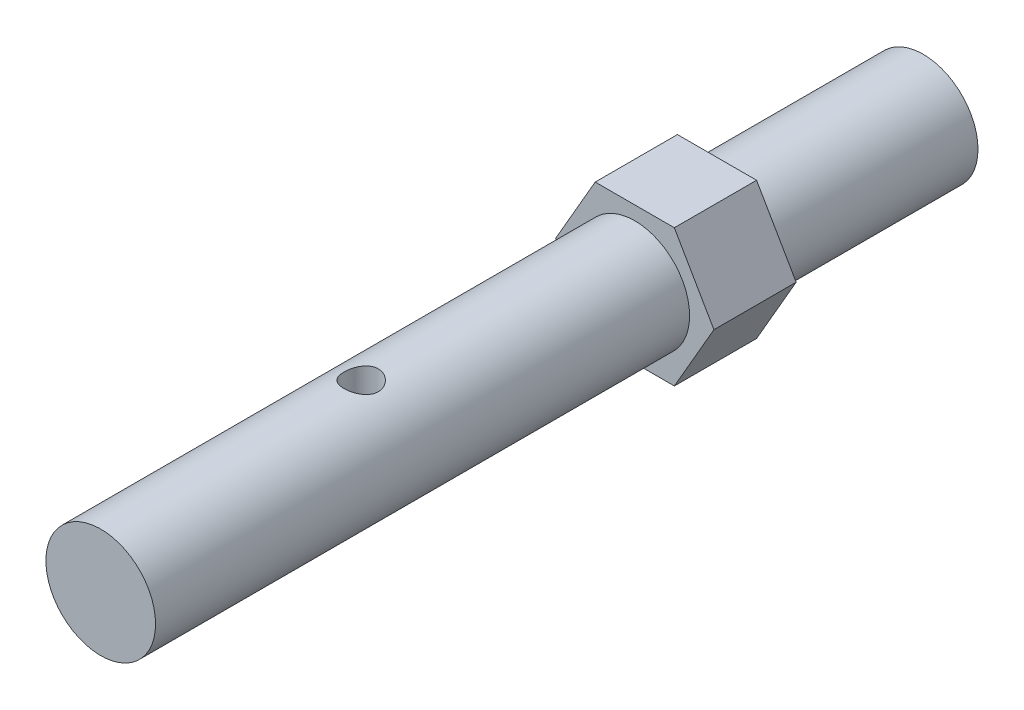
ISO-10303-21;
HEADER;
FILE_DESCRIPTION(('STEP AP214'),'2;1');
FILE_NAME('part.step','',(''),(''),'','','');
FILE_SCHEMA(('AUTOMOTIVE_DESIGN { 1 0 10303 214 1 1 1 1 }'));
ENDSEC;
DATA;
#1=APPLICATION_CONTEXT('core data for automotive mechanical design processes');
#2=APPLICATION_PROTOCOL_DEFINITION('international standard','automotive_design',2000,#1);
#3=PRODUCT_CONTEXT('',#1,'mechanical');
#4=PRODUCT('Part','Part','',(#3));
#5=PRODUCT_RELATED_PRODUCT_CATEGORY('part','',(#4));
#6=PRODUCT_DEFINITION_FORMATION('','',#4);
#7=PRODUCT_DEFINITION_CONTEXT('part definition',#1,'design');
#8=PRODUCT_DEFINITION('design','',#6,#7);
#9=PRODUCT_DEFINITION_SHAPE('','',#8);
#10=(LENGTH_UNIT() NAMED_UNIT(*) SI_UNIT(.MILLI.,.METRE.));
#11=(NAMED_UNIT(*) PLANE_ANGLE_UNIT() SI_UNIT($,.RADIAN.));
#12=(NAMED_UNIT(*) SI_UNIT($,.STERADIAN.) SOLID_ANGLE_UNIT());
#13=UNCERTAINTY_MEASURE_WITH_UNIT(LENGTH_MEASURE(1.E-05),#10,'distance_accuracy_value','');
#14=(GEOMETRIC_REPRESENTATION_CONTEXT(3) GLOBAL_UNCERTAINTY_ASSIGNED_CONTEXT((#13)) GLOBAL_UNIT_ASSIGNED_CONTEXT((#10,
#11,#12)) REPRESENTATION_CONTEXT('',''));
#15=CARTESIAN_POINT('',(0.,0.,0.));
#16=DIRECTION('',(0.,0.,1.));
#17=DIRECTION('',(1.,0.,0.));
#18=AXIS2_PLACEMENT_3D('',#15,#16,#17);
#19=CARTESIAN_POINT('',(0.,0.,23.8125));
#20=DIRECTION('',(0.,0.,-1.));
#21=DIRECTION('',(-1.,0.,0.));
#22=AXIS2_PLACEMENT_3D('',#19,#20,#21);
#23=CYLINDRICAL_SURFACE('',#22,3.175);
#24=CARTESIAN_POINT('',(0.,0.,-23.8125));
#25=DIRECTION('',(0.,0.,1.));
#26=DIRECTION('',(1.,0.,0.));
#27=AXIS2_PLACEMENT_3D('',#24,#25,#26);
#28=CIRCLE('',#27,3.175);
#29=CARTESIAN_POINT('',(3.175,0.,-23.8125));
#30=VERTEX_POINT('',#29);
#31=EDGE_CURVE('E149',#30,#30,#28,.T.);
#32=ORIENTED_EDGE('',*,*,#31,.T.);
#33=EDGE_LOOP('',(#32));
#34=FACE_BOUND('',#33,.T.);
#35=CARTESIAN_POINT('',(0.,0.,-11.8745));
#36=DIRECTION('',(0.,0.,1.));
#37=DIRECTION('',(1.,0.,0.));
#38=AXIS2_PLACEMENT_3D('',#35,#36,#37);
#39=CIRCLE('',#38,3.175);
#40=CARTESIAN_POINT('',(3.175,0.,-11.8745));
#41=VERTEX_POINT('',#40);
#42=EDGE_CURVE('E11',#41,#41,#39,.T.);
#43=ORIENTED_EDGE('',*,*,#42,.F.);
#44=EDGE_LOOP('',(#43));
#45=FACE_BOUND('',#44,.T.);
#46=ADVANCED_FACE('F33',(#34,#45),#23,.T.);
#47=CARTESIAN_POINT('',(0.,0.,-23.8125));
#48=DIRECTION('',(0.,0.,1.));
#49=DIRECTION('',(1.,0.,0.));
#50=AXIS2_PLACEMENT_3D('',#47,#48,#49);
#51=PLANE('',#50);
#52=ORIENTED_EDGE('',*,*,#31,.F.);
#53=EDGE_LOOP('',(#52));
#54=FACE_BOUND('',#53,.T.);
#55=ADVANCED_FACE('F174',(#54),#51,.F.);
#56=CARTESIAN_POINT('',(2.29135888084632,-3.96875,-11.8745));
#57=DIRECTION('',(0.866025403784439,-0.5,0.));
#58=DIRECTION('',(0.5,0.866025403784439,0.));
#59=AXIS2_PLACEMENT_3D('',#56,#57,#58);
#60=PLANE('',#59);
#61=DIRECTION('',(0.5,0.866025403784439,0.));
#62=VECTOR('',#61,1.);
#63=CARTESIAN_POINT('',(2.29135888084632,-3.96875,-7.11199999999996));
#64=LINE('',#63,#62);
#65=CARTESIAN_POINT('',(2.29135888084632,-3.96875,-7.11199999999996));
#66=VERTEX_POINT('',#65);
#67=CARTESIAN_POINT('',(4.58271776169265,0.,-7.11199999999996));
#68=VERTEX_POINT('',#67);
#69=EDGE_CURVE('E122',#66,#68,#64,.T.);
#70=ORIENTED_EDGE('',*,*,#69,.F.);
#71=DIRECTION('',(0.,0.,1.));
#72=VECTOR('',#71,1.);
#73=CARTESIAN_POINT('',(2.29135888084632,-3.96875,-11.8745));
#74=LINE('',#73,#72);
#75=CARTESIAN_POINT('',(2.29135888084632,-3.96875,-11.8745));
#76=VERTEX_POINT('',#75);
#77=EDGE_CURVE('E51',#76,#66,#74,.T.);
#78=ORIENTED_EDGE('',*,*,#77,.F.);
#79=DIRECTION('',(0.5,0.866025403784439,0.));
#80=VECTOR('',#79,1.);
#81=CARTESIAN_POINT('',(2.29135888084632,-3.96875,-11.8745));
#82=LINE('',#81,#80);
#83=CARTESIAN_POINT('',(4.58271776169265,0.,-11.8745));
#84=VERTEX_POINT('',#83);
#85=EDGE_CURVE('E137',#76,#84,#82,.T.);
#86=ORIENTED_EDGE('',*,*,#85,.T.);
#87=DIRECTION('',(0.,0.,1.));
#88=VECTOR('',#87,1.);
#89=CARTESIAN_POINT('',(4.58271776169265,0.,-11.8745));
#90=LINE('',#89,#88);
#91=EDGE_CURVE('E86',#84,#68,#90,.T.);
#92=ORIENTED_EDGE('',*,*,#91,.T.);
#93=EDGE_LOOP('',(#70,#78,#86,#92));
#94=FACE_BOUND('',#93,.T.);
#95=ADVANCED_FACE('F168',(#94),#60,.T.);
#96=CARTESIAN_POINT('',(-2.29135888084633,-3.96875,-11.8745));
#97=DIRECTION('',(0.,-1.,0.));
#98=DIRECTION('',(1.,0.,0.));
#99=AXIS2_PLACEMENT_3D('',#96,#97,#98);
#100=PLANE('',#99);
#101=DIRECTION('',(1.,0.,0.));
#102=VECTOR('',#101,1.);
#103=CARTESIAN_POINT('',(-2.29135888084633,-3.96875,-7.11199999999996));
#104=LINE('',#103,#102);
#105=CARTESIAN_POINT('',(-2.29135888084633,-3.96875,-7.11199999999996));
#106=VERTEX_POINT('',#105);
#107=EDGE_CURVE('E134',#106,#66,#104,.T.);
#108=ORIENTED_EDGE('',*,*,#107,.F.);
#109=DIRECTION('',(0.,0.,1.));
#110=VECTOR('',#109,1.);
#111=CARTESIAN_POINT('',(-2.29135888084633,-3.96875,-11.8745));
#112=LINE('',#111,#110);
#113=CARTESIAN_POINT('',(-2.29135888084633,-3.96875,-11.8745));
#114=VERTEX_POINT('',#113);
#115=EDGE_CURVE('E74',#114,#106,#112,.T.);
#116=ORIENTED_EDGE('',*,*,#115,.F.);
#117=DIRECTION('',(1.,0.,0.));
#118=VECTOR('',#117,1.);
#119=CARTESIAN_POINT('',(-2.29135888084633,-3.96875,-11.8745));
#120=LINE('',#119,#118);
#121=EDGE_CURVE('E112',#114,#76,#120,.T.);
#122=ORIENTED_EDGE('',*,*,#121,.T.);
#123=ORIENTED_EDGE('',*,*,#77,.T.);
#124=EDGE_LOOP('',(#108,#116,#122,#123));
#125=FACE_BOUND('',#124,.T.);
#126=ADVANCED_FACE('F181',(#125),#100,.T.);
#127=CARTESIAN_POINT('',(-4.58271776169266,0.,-11.8745));
#128=DIRECTION('',(-0.866025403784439,-0.5,0.));
#129=DIRECTION('',(0.5,-0.866025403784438,0.));
#130=AXIS2_PLACEMENT_3D('',#127,#128,#129);
#131=PLANE('',#130);
#132=DIRECTION('',(0.5,-0.866025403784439,0.));
#133=VECTOR('',#132,1.);
#134=CARTESIAN_POINT('',(-4.58271776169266,0.,-7.11199999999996));
#135=LINE('',#134,#133);
#136=CARTESIAN_POINT('',(-4.58271776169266,0.,-7.11199999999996));
#137=VERTEX_POINT('',#136);
#138=EDGE_CURVE('E99',#137,#106,#135,.T.);
#139=ORIENTED_EDGE('',*,*,#138,.F.);
#140=DIRECTION('',(0.,0.,1.));
#141=VECTOR('',#140,1.);
#142=CARTESIAN_POINT('',(-4.58271776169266,0.,-11.8745));
#143=LINE('',#142,#141);
#144=CARTESIAN_POINT('',(-4.58271776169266,0.,-11.8745));
#145=VERTEX_POINT('',#144);
#146=EDGE_CURVE('E94',#145,#137,#143,.T.);
#147=ORIENTED_EDGE('',*,*,#146,.F.);
#148=DIRECTION('',(0.5,-0.866025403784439,0.));
#149=VECTOR('',#148,1.);
#150=CARTESIAN_POINT('',(-4.58271776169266,0.,-11.8745));
#151=LINE('',#150,#149);
#152=EDGE_CURVE('E97',#145,#114,#151,.T.);
#153=ORIENTED_EDGE('',*,*,#152,.T.);
#154=ORIENTED_EDGE('',*,*,#115,.T.);
#155=EDGE_LOOP('',(#139,#147,#153,#154));
#156=FACE_BOUND('',#155,.T.);
#157=ADVANCED_FACE('F96',(#156),#131,.T.);
#158=CARTESIAN_POINT('',(-2.29135888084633,3.96875,-11.8745));
#159=DIRECTION('',(-0.866025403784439,0.5,0.));
#160=DIRECTION('',(-0.5,-0.866025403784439,0.));
#161=AXIS2_PLACEMENT_3D('',#158,#159,#160);
#162=PLANE('',#161);
#163=DIRECTION('',(-0.5,-0.866025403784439,0.));
#164=VECTOR('',#163,1.);
#165=CARTESIAN_POINT('',(-2.29135888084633,3.96875,-7.11199999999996));
#166=LINE('',#165,#164);
#167=CARTESIAN_POINT('',(-2.29135888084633,3.96875,-7.11199999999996));
#168=VERTEX_POINT('',#167);
#169=EDGE_CURVE('E131',#168,#137,#166,.T.);
#170=ORIENTED_EDGE('',*,*,#169,.F.);
#171=DIRECTION('',(0.,0.,1.));
#172=VECTOR('',#171,1.);
#173=CARTESIAN_POINT('',(-2.29135888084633,3.96875,-11.8745));
#174=LINE('',#173,#172);
#175=CARTESIAN_POINT('',(-2.29135888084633,3.96875,-11.8745));
#176=VERTEX_POINT('',#175);
#177=EDGE_CURVE('E104',#176,#168,#174,.T.);
#178=ORIENTED_EDGE('',*,*,#177,.F.);
#179=DIRECTION('',(-0.5,-0.866025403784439,0.));
#180=VECTOR('',#179,1.);
#181=CARTESIAN_POINT('',(-2.29135888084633,3.96875,-11.8745));
#182=LINE('',#181,#180);
#183=EDGE_CURVE('E110',#176,#145,#182,.T.);
#184=ORIENTED_EDGE('',*,*,#183,.T.);
#185=ORIENTED_EDGE('',*,*,#146,.T.);
#186=EDGE_LOOP('',(#170,#178,#184,#185));
#187=FACE_BOUND('',#186,.T.);
#188=ADVANCED_FACE('F114',(#187),#162,.T.);
#189=CARTESIAN_POINT('',(2.29135888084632,3.96875,-11.8745));
#190=DIRECTION('',(0.,1.,0.));
#191=DIRECTION('',(0.,0.,1.));
#192=AXIS2_PLACEMENT_3D('',#189,#190,#191);
#193=PLANE('',#192);
#194=DIRECTION('',(-1.,0.,0.));
#195=VECTOR('',#194,1.);
#196=CARTESIAN_POINT('',(2.29135888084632,3.96875,-7.11199999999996));
#197=LINE('',#196,#195);
#198=CARTESIAN_POINT('',(2.29135888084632,3.96875,-7.11199999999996));
#199=VERTEX_POINT('',#198);
#200=EDGE_CURVE('E128',#199,#168,#197,.T.);
#201=ORIENTED_EDGE('',*,*,#200,.F.);
#202=DIRECTION('',(0.,0.,1.));
#203=VECTOR('',#202,1.);
#204=CARTESIAN_POINT('',(2.29135888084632,3.96875,-11.8745));
#205=LINE('',#204,#203);
#206=CARTESIAN_POINT('',(2.29135888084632,3.96875,-11.8745));
#207=VERTEX_POINT('',#206);
#208=EDGE_CURVE('E142',#207,#199,#205,.T.);
#209=ORIENTED_EDGE('',*,*,#208,.F.);
#210=DIRECTION('',(-1.,0.,0.));
#211=VECTOR('',#210,1.);
#212=CARTESIAN_POINT('',(2.29135888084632,3.96875,-11.8745));
#213=LINE('',#212,#211);
#214=EDGE_CURVE('E115',#207,#176,#213,.T.);
#215=ORIENTED_EDGE('',*,*,#214,.T.);
#216=ORIENTED_EDGE('',*,*,#177,.T.);
#217=EDGE_LOOP('',(#201,#209,#215,#216));
#218=FACE_BOUND('',#217,.T.);
#219=ADVANCED_FACE('F196',(#218),#193,.T.);
#220=CARTESIAN_POINT('',(4.58271776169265,0.,-11.8745));
#221=DIRECTION('',(0.866025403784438,0.5,0.));
#222=DIRECTION('',(-0.5,0.866025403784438,0.));
#223=AXIS2_PLACEMENT_3D('',#220,#221,#222);
#224=PLANE('',#223);
#225=DIRECTION('',(-0.5,0.866025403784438,0.));
#226=VECTOR('',#225,1.);
#227=CARTESIAN_POINT('',(4.58271776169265,0.,-7.11199999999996));
#228=LINE('',#227,#226);
#229=EDGE_CURVE('E125',#68,#199,#228,.T.);
#230=ORIENTED_EDGE('',*,*,#229,.F.);
#231=ORIENTED_EDGE('',*,*,#91,.F.);
#232=DIRECTION('',(-0.5,0.866025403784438,0.));
#233=VECTOR('',#232,1.);
#234=CARTESIAN_POINT('',(4.58271776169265,0.,-11.8745));
#235=LINE('',#234,#233);
#236=EDGE_CURVE('E117',#84,#207,#235,.T.);
#237=ORIENTED_EDGE('',*,*,#236,.T.);
#238=ORIENTED_EDGE('',*,*,#208,.T.);
#239=EDGE_LOOP('',(#230,#231,#237,#238));
#240=FACE_BOUND('',#239,.T.);
#241=ADVANCED_FACE('F188',(#240),#224,.T.);
#242=CARTESIAN_POINT('',(0.,0.,-11.8745));
#243=DIRECTION('',(0.,0.,1.));
#244=DIRECTION('',(1.,0.,0.));
#245=AXIS2_PLACEMENT_3D('',#242,#243,#244);
#246=PLANE('',#245);
#247=ORIENTED_EDGE('',*,*,#42,.T.);
#248=EDGE_LOOP('',(#247));
#249=FACE_BOUND('',#248,.T.);
#250=ORIENTED_EDGE('',*,*,#85,.F.);
#251=ORIENTED_EDGE('',*,*,#121,.F.);
#252=ORIENTED_EDGE('',*,*,#152,.F.);
#253=ORIENTED_EDGE('',*,*,#183,.F.);
#254=ORIENTED_EDGE('',*,*,#214,.F.);
#255=ORIENTED_EDGE('',*,*,#236,.F.);
#256=EDGE_LOOP('',(#250,#251,#252,#253,#254,#255));
#257=FACE_BOUND('',#256,.T.);
#258=ADVANCED_FACE('F108',(#249,#257),#246,.F.);
#259=CARTESIAN_POINT('',(0.,0.,-7.11199999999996));
#260=DIRECTION('',(0.,0.,1.));
#261=DIRECTION('',(1.,0.,0.));
#262=AXIS2_PLACEMENT_3D('',#259,#260,#261);
#263=PLANE('',#262);
#264=CARTESIAN_POINT('',(0.,0.,-7.11199999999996));
#265=DIRECTION('',(0.,0.,1.));
#266=DIRECTION('',(1.,0.,0.));
#267=AXIS2_PLACEMENT_3D('',#264,#265,#266);
#268=CIRCLE('',#267,3.175);
#269=CARTESIAN_POINT('',(3.175,0.,-7.11199999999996));
#270=VERTEX_POINT('',#269);
#271=EDGE_CURVE('E139',#270,#270,#268,.T.);
#272=ORIENTED_EDGE('',*,*,#271,.F.);
#273=EDGE_LOOP('',(#272));
#274=FACE_BOUND('',#273,.T.);
#275=ORIENTED_EDGE('',*,*,#69,.T.);
#276=ORIENTED_EDGE('',*,*,#229,.T.);
#277=ORIENTED_EDGE('',*,*,#200,.T.);
#278=ORIENTED_EDGE('',*,*,#169,.T.);
#279=ORIENTED_EDGE('',*,*,#138,.T.);
#280=ORIENTED_EDGE('',*,*,#107,.T.);
#281=EDGE_LOOP('',(#275,#276,#277,#278,#279,#280));
#282=FACE_BOUND('',#281,.T.);
#283=ADVANCED_FACE('F172',(#274,#282),#263,.T.);
#284=CARTESIAN_POINT('',(0.,0.,23.8125));
#285=DIRECTION('',(0.,0.,1.));
#286=DIRECTION('',(1.,0.,0.));
#287=AXIS2_PLACEMENT_3D('',#284,#285,#286);
#288=PLANE('',#287);
#289=CARTESIAN_POINT('',(0.,0.,23.8125));
#290=DIRECTION('',(0.,0.,1.));
#291=DIRECTION('',(1.,0.,0.));
#292=AXIS2_PLACEMENT_3D('',#289,#290,#291);
#293=CIRCLE('',#292,3.175);
#294=CARTESIAN_POINT('',(3.175,0.,23.8125));
#295=VERTEX_POINT('',#294);
#296=EDGE_CURVE('E145',#295,#295,#293,.T.);
#297=ORIENTED_EDGE('',*,*,#296,.T.);
#298=EDGE_LOOP('',(#297));
#299=FACE_BOUND('',#298,.T.);
#300=ADVANCED_FACE('F166',(#299),#288,.T.);
#301=CARTESIAN_POINT('',(0.,-3.175,8.73124999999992));
#302=DIRECTION('',(0.,1.,0.));
#303=DIRECTION('',(0.,0.,1.));
#304=AXIS2_PLACEMENT_3D('',#301,#302,#303);
#305=CYLINDRICAL_SURFACE('',#304,0.992187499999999);
#306=CARTESIAN_POINT('',(0.,3.175,9.72343749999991));
#307=CARTESIAN_POINT('',(-0.0543236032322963,3.17499972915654,9.72343714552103));
#308=CARTESIAN_POINT('',(-0.108650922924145,3.17359264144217,9.71896136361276));
#309=CARTESIAN_POINT('',(-0.215716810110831,3.1681173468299,9.70122342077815));
#310=CARTESIAN_POINT('',(-0.268455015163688,3.16404853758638,9.68795927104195));
#311=CARTESIAN_POINT('',(-0.370783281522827,3.15369428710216,9.6531355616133));
#312=CARTESIAN_POINT('',(-0.420378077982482,3.14741227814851,9.63158884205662));
#313=CARTESIAN_POINT('',(-0.515250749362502,3.13328025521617,9.58086625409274));
#314=CARTESIAN_POINT('',(-0.560527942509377,3.1254299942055,9.55168918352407));
#315=CARTESIAN_POINT('',(-0.646878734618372,3.10872357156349,9.48558555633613));
#316=CARTESIAN_POINT('',(-0.687800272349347,3.09984549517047,9.44846592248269));
#317=CARTESIAN_POINT('',(-0.762950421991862,3.08221099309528,9.36794196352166));
#318=CARTESIAN_POINT('',(-0.797177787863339,3.07345459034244,9.32453647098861));
#319=CARTESIAN_POINT('',(-0.858792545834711,3.05681971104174,9.23135650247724));
#320=CARTESIAN_POINT('',(-0.885989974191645,3.0489682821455,9.18145112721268));
#321=CARTESIAN_POINT('',(-0.931542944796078,3.03536192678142,9.07748984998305));
#322=CARTESIAN_POINT('',(-0.949900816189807,3.02960644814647,9.02343504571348));
#323=CARTESIAN_POINT('',(-0.976697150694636,3.02107288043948,8.91442521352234));
#324=CARTESIAN_POINT('',(-0.985417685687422,3.01821034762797,8.85954631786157));
#325=CARTESIAN_POINT('',(-0.993573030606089,3.01553606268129,8.7490354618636));
#326=CARTESIAN_POINT('',(-0.993010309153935,3.01572349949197,8.69340370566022));
#327=CARTESIAN_POINT('',(-0.982835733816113,3.01905343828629,8.58529964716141));
#328=CARTESIAN_POINT('',(-0.973582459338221,3.02207883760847,8.5327893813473));
#329=CARTESIAN_POINT('',(-0.946870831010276,3.03055357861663,8.43010747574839));
#330=CARTESIAN_POINT('',(-0.929411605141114,3.03600317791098,8.37993608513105));
#331=CARTESIAN_POINT('',(-0.886530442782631,3.04880203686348,8.28250189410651));
#332=CARTESIAN_POINT('',(-0.860995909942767,3.0561778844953,8.23529229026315));
#333=CARTESIAN_POINT('',(-0.802767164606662,3.07198598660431,8.14571033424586));
#334=CARTESIAN_POINT('',(-0.770071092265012,3.08041851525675,8.10333924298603));
#335=CARTESIAN_POINT('',(-0.696687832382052,3.09785962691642,8.02260988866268));
#336=CARTESIAN_POINT('',(-0.65570462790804,3.10687695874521,7.98452210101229));
#337=CARTESIAN_POINT('',(-0.56782049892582,3.12413309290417,7.91569418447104));
#338=CARTESIAN_POINT('',(-0.520919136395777,3.13237183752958,7.88495459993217));
#339=CARTESIAN_POINT('',(-0.422008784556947,3.14722902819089,7.83151239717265));
#340=CARTESIAN_POINT('',(-0.36996283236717,3.15383434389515,7.80887429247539));
#341=CARTESIAN_POINT('',(-0.262547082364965,3.16458564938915,7.77275480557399));
#342=CARTESIAN_POINT('',(-0.207178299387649,3.16873238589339,7.75927064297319));
#343=CARTESIAN_POINT('',(-0.0969844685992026,3.17397915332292,7.74230255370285));
#344=CARTESIAN_POINT('',(-0.042221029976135,3.17519068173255,7.73845246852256));
#345=CARTESIAN_POINT('',(0.0671753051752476,3.17476028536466,7.7398294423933));
#346=CARTESIAN_POINT('',(0.121808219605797,3.17311877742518,7.74505517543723));
#347=CARTESIAN_POINT('',(0.22798034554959,3.16724001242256,7.76414150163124));
#348=CARTESIAN_POINT('',(0.279562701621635,3.16306829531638,7.77778421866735));
#349=CARTESIAN_POINT('',(0.379691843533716,3.15261721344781,7.81305139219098));
#350=CARTESIAN_POINT('',(0.428238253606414,3.14633758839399,7.83467683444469));
#351=CARTESIAN_POINT('',(0.522233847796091,3.13212593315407,7.88588499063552));
#352=CARTESIAN_POINT('',(0.567578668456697,3.12415735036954,7.91564884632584));
#353=CARTESIAN_POINT('',(0.652752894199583,3.10747894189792,7.9820716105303));
#354=CARTESIAN_POINT('',(0.692580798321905,3.09876891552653,8.01873238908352));
#355=CARTESIAN_POINT('',(0.767228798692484,3.08115489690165,8.09963049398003));
#356=CARTESIAN_POINT('',(0.801787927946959,3.07225689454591,8.14411047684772));
#357=CARTESIAN_POINT('',(0.862974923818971,3.05563545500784,8.2384317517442));
#358=CARTESIAN_POINT('',(0.889602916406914,3.04791199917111,8.28827295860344));
#359=CARTESIAN_POINT('',(0.93400628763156,3.03459977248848,8.39179898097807));
#360=CARTESIAN_POINT('',(0.95181594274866,3.02900275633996,8.44546797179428));
#361=CARTESIAN_POINT('',(0.978081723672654,3.02062491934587,8.55525379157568));
#362=CARTESIAN_POINT('',(0.986541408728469,3.01784302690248,8.61136968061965));
#363=CARTESIAN_POINT('',(0.993611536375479,3.01552207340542,8.7217282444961));
#364=CARTESIAN_POINT('',(0.992650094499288,3.01584204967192,8.77594086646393));
#365=CARTESIAN_POINT('',(0.981938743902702,3.01934634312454,8.88339170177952));
#366=CARTESIAN_POINT('',(0.972189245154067,3.02253052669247,8.93662996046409));
#367=CARTESIAN_POINT('',(0.944465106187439,3.03130596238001,9.03985526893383));
#368=CARTESIAN_POINT('',(0.926612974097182,3.03686129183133,9.08987850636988));
#369=CARTESIAN_POINT('',(0.883286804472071,3.04974390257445,9.18625957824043));
#370=CARTESIAN_POINT('',(0.85781121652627,3.05707154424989,9.23261666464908));
#371=CARTESIAN_POINT('',(0.798795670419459,3.07303080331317,9.32231273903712));
#372=CARTESIAN_POINT('',(0.764979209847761,3.08170221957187,9.3654627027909));
#373=CARTESIAN_POINT('',(0.690728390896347,3.09918892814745,9.44561414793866));
#374=CARTESIAN_POINT('',(0.650292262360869,3.10800425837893,9.48261397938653));
#375=CARTESIAN_POINT('',(0.562361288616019,3.12513084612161,9.55062426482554));
#376=CARTESIAN_POINT('',(0.514679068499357,3.13341624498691,9.58139969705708));
#377=CARTESIAN_POINT('',(0.414559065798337,3.14822498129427,9.63445726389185));
#378=CARTESIAN_POINT('',(0.362123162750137,3.15474901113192,9.656742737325));
#379=CARTESIAN_POINT('',(0.258562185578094,3.16484516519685,9.69056939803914));
#380=CARTESIAN_POINT('',(0.207700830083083,3.16862016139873,9.70285942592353));
#381=CARTESIAN_POINT('',(0.104560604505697,3.17369745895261,9.71929282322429));
#382=CARTESIAN_POINT('',(0.0522820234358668,3.17500026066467,9.72343784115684));
#383=CARTESIAN_POINT('',(0.,3.175,9.72343749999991));
#384=B_SPLINE_CURVE_WITH_KNOTS('',3,(#306,#307,#308,#309,#310,#311,#312,#313,#314,#315,#316,
#317,#318,#319,#320,#321,#322,#323,#324,#325,#326,#327,#328,#329,#330,#331,#332,#333,#334,#335,
#336,#337,#338,#339,#340,#341,#342,#343,#344,#345,#346,#347,#348,#349,#350,#351,#352,#353,#354,
#355,#356,#357,#358,#359,#360,#361,#362,#363,#364,#365,#366,#367,#368,#369,#370,#371,#372,#373,
#374,#375,#376,#377,#378,#379,#380,#381,#382,#383),.UNSPECIFIED.,.T.,.F.,(4,2,2,2,2,2,2,2,2,2,2,
2,2,2,2,2,2,2,2,2,2,2,2,2,2,2,2,2,2,2,2,2,2,2,2,2,2,2,4),(0.,0.162778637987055,
0.325594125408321,0.488158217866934,0.650747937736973,0.817862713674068,0.985008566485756,
1.15628555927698,1.32751739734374,1.49359262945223,1.65962369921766,1.81909178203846,
1.97857681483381,2.14039166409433,2.30224858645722,2.47147355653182,2.64071105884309,
2.81126771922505,2.98177255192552,3.14569132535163,3.30958615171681,3.46940684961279,
3.62924728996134,3.7929845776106,3.95676632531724,4.12703786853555,4.29730670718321,
4.46690841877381,4.63644554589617,4.79831561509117,4.96017813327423,5.11967093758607,
5.27919620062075,5.4449623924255,5.61077298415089,5.7819978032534,5.95315521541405,
6.1098480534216,6.26650917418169),.UNSPECIFIED.);
#385=CARTESIAN_POINT('',(0.,3.175,9.72343749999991));
#386=VERTEX_POINT('',#385);
#387=EDGE_CURVE('E148',#386,#386,#384,.T.);
#388=ORIENTED_EDGE('',*,*,#387,.F.);
#389=EDGE_LOOP('',(#388));
#390=FACE_BOUND('',#389,.T.);
#391=CARTESIAN_POINT('',(0.,-3.175,9.72343749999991));
#392=CARTESIAN_POINT('',(0.0543236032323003,-3.17499972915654,9.72343714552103));
#393=CARTESIAN_POINT('',(0.108650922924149,-3.17359264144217,9.71896136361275));
#394=CARTESIAN_POINT('',(0.215716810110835,-3.1681173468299,9.70122342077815));
#395=CARTESIAN_POINT('',(0.268455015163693,-3.16404853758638,9.68795927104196));
#396=CARTESIAN_POINT('',(0.370783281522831,-3.15369428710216,9.6531355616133));
#397=CARTESIAN_POINT('',(0.420378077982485,-3.14741227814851,9.63158884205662));
#398=CARTESIAN_POINT('',(0.515250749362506,-3.13328025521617,9.58086625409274));
#399=CARTESIAN_POINT('',(0.560527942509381,-3.1254299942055,9.55168918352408));
#400=CARTESIAN_POINT('',(0.646878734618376,-3.10872357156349,9.48558555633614));
#401=CARTESIAN_POINT('',(0.687800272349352,-3.09984549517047,9.44846592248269));
#402=CARTESIAN_POINT('',(0.762950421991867,-3.08221099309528,9.36794196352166));
#403=CARTESIAN_POINT('',(0.797177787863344,-3.07345459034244,9.32453647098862));
#404=CARTESIAN_POINT('',(0.858792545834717,-3.05681971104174,9.23135650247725));
#405=CARTESIAN_POINT('',(0.885989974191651,-3.0489682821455,9.18145112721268));
#406=CARTESIAN_POINT('',(0.931542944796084,-3.03536192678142,9.07748984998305));
#407=CARTESIAN_POINT('',(0.949900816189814,-3.02960644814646,9.02343504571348));
#408=CARTESIAN_POINT('',(0.976697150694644,-3.02107288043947,8.91442521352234));
#409=CARTESIAN_POINT('',(0.985417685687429,-3.01821034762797,8.85954631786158));
#410=CARTESIAN_POINT('',(0.993573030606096,-3.01553606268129,8.7490354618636));
#411=CARTESIAN_POINT('',(0.993010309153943,-3.01572349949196,8.69340370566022));
#412=CARTESIAN_POINT('',(0.982835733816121,-3.01905343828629,8.58529964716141));
#413=CARTESIAN_POINT('',(0.97358245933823,-3.02207883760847,8.5327893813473));
#414=CARTESIAN_POINT('',(0.946870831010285,-3.03055357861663,8.4301074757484));
#415=CARTESIAN_POINT('',(0.929411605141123,-3.03600317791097,8.37993608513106));
#416=CARTESIAN_POINT('',(0.886530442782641,-3.04880203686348,8.28250189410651));
#417=CARTESIAN_POINT('',(0.860995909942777,-3.05617788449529,8.23529229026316));
#418=CARTESIAN_POINT('',(0.802767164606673,-3.0719859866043,8.14571033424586));
#419=CARTESIAN_POINT('',(0.770071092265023,-3.08041851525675,8.10333924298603));
#420=CARTESIAN_POINT('',(0.696687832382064,-3.09785962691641,8.02260988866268));
#421=CARTESIAN_POINT('',(0.655704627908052,-3.10687695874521,7.98452210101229));
#422=CARTESIAN_POINT('',(0.567820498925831,-3.12413309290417,7.91569418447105));
#423=CARTESIAN_POINT('',(0.520919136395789,-3.13237183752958,7.88495459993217));
#424=CARTESIAN_POINT('',(0.422008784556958,-3.14722902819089,7.83151239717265));
#425=CARTESIAN_POINT('',(0.369962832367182,-3.15383434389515,7.80887429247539));
#426=CARTESIAN_POINT('',(0.262547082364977,-3.16458564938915,7.77275480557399));
#427=CARTESIAN_POINT('',(0.207178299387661,-3.16873238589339,7.75927064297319));
#428=CARTESIAN_POINT('',(0.0969844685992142,-3.17397915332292,7.74230255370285));
#429=CARTESIAN_POINT('',(0.0422210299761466,-3.17519068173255,7.73845246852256));
#430=CARTESIAN_POINT('',(-0.0671753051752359,-3.17476028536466,7.7398294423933));
#431=CARTESIAN_POINT('',(-0.121808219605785,-3.17311877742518,7.74505517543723));
#432=CARTESIAN_POINT('',(-0.227980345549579,-3.16724001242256,7.76414150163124));
#433=CARTESIAN_POINT('',(-0.279562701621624,-3.16306829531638,7.77778421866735));
#434=CARTESIAN_POINT('',(-0.379691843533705,-3.15261721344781,7.81305139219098));
#435=CARTESIAN_POINT('',(-0.428238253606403,-3.14633758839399,7.83467683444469));
#436=CARTESIAN_POINT('',(-0.52223384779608,-3.13212593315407,7.88588499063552));
#437=CARTESIAN_POINT('',(-0.567578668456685,-3.12415735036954,7.91564884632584));
#438=CARTESIAN_POINT('',(-0.652752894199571,-3.10747894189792,7.9820716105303));
#439=CARTESIAN_POINT('',(-0.692580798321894,-3.09876891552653,8.01873238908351));
#440=CARTESIAN_POINT('',(-0.767228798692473,-3.08115489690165,8.09963049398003));
#441=CARTESIAN_POINT('',(-0.801787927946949,-3.07225689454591,8.14411047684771));
#442=CARTESIAN_POINT('',(-0.862974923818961,-3.05563545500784,8.23843175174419));
#443=CARTESIAN_POINT('',(-0.889602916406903,-3.04791199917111,8.28827295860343));
#444=CARTESIAN_POINT('',(-0.93400628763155,-3.03459977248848,8.39179898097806));
#445=CARTESIAN_POINT('',(-0.95181594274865,-3.02900275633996,8.44546797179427));
#446=CARTESIAN_POINT('',(-0.978081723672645,-3.02062491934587,8.55525379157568));
#447=CARTESIAN_POINT('',(-0.986541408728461,-3.01784302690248,8.61136968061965));
#448=CARTESIAN_POINT('',(-0.993611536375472,-3.01552207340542,8.7217282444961));
#449=CARTESIAN_POINT('',(-0.99265009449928,-3.01584204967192,8.77594086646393));
#450=CARTESIAN_POINT('',(-0.981938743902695,-3.01934634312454,8.88339170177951));
#451=CARTESIAN_POINT('',(-0.972189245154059,-3.02253052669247,8.93662996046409));
#452=CARTESIAN_POINT('',(-0.944465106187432,-3.03130596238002,9.03985526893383));
#453=CARTESIAN_POINT('',(-0.926612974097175,-3.03686129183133,9.08987850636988));
#454=CARTESIAN_POINT('',(-0.883286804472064,-3.04974390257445,9.18625957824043));
#455=CARTESIAN_POINT('',(-0.857811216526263,-3.05707154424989,9.23261666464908));
#456=CARTESIAN_POINT('',(-0.798795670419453,-3.07303080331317,9.32231273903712));
#457=CARTESIAN_POINT('',(-0.764979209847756,-3.08170221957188,9.36546270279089));
#458=CARTESIAN_POINT('',(-0.690728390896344,-3.09918892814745,9.44561414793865));
#459=CARTESIAN_POINT('',(-0.650292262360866,-3.10800425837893,9.48261397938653));
#460=CARTESIAN_POINT('',(-0.562361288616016,-3.12513084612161,9.55062426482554));
#461=CARTESIAN_POINT('',(-0.514679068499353,-3.13341624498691,9.58139969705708));
#462=CARTESIAN_POINT('',(-0.414559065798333,-3.14822498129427,9.63445726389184));
#463=CARTESIAN_POINT('',(-0.362123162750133,-3.15474901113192,9.65674273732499));
#464=CARTESIAN_POINT('',(-0.25856218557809,-3.16484516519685,9.69056939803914));
#465=CARTESIAN_POINT('',(-0.207700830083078,-3.16862016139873,9.70285942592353));
#466=CARTESIAN_POINT('',(-0.104560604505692,-3.17369745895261,9.71929282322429));
#467=CARTESIAN_POINT('',(-0.0522820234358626,-3.17500026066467,9.72343784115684));
#468=CARTESIAN_POINT('',(0.,-3.175,9.72343749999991));
#469=B_SPLINE_CURVE_WITH_KNOTS('',3,(#391,#392,#393,#394,#395,#396,#397,#398,#399,#400,#401,
#402,#403,#404,#405,#406,#407,#408,#409,#410,#411,#412,#413,#414,#415,#416,#417,#418,#419,#420,
#421,#422,#423,#424,#425,#426,#427,#428,#429,#430,#431,#432,#433,#434,#435,#436,#437,#438,#439,
#440,#441,#442,#443,#444,#445,#446,#447,#448,#449,#450,#451,#452,#453,#454,#455,#456,#457,#458,
#459,#460,#461,#462,#463,#464,#465,#466,#467,#468),.UNSPECIFIED.,.T.,.F.,(4,2,2,2,2,2,2,2,2,2,2,
2,2,2,2,2,2,2,2,2,2,2,2,2,2,2,2,2,2,2,2,2,2,2,2,2,2,2,4),(0.,0.162778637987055,
0.325594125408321,0.488158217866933,0.650747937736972,0.817862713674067,0.985008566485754,
1.15628555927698,1.32751739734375,1.49359262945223,1.65962369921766,1.81909178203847,
1.97857681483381,2.14039166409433,2.30224858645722,2.47147355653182,2.64071105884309,
2.81126771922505,2.98177255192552,3.14569132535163,3.30958615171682,3.46940684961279,
3.62924728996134,3.7929845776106,3.95676632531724,4.12703786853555,4.29730670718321,
4.46690841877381,4.63644554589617,4.79831561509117,4.96017813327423,5.11967093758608,
5.27919620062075,5.44496239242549,5.61077298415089,5.7819978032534,5.95315521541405,
6.10984805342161,6.26650917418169),.UNSPECIFIED.);
#470=CARTESIAN_POINT('',(0.,-3.175,9.72343749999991));
#471=VERTEX_POINT('',#470);
#472=EDGE_CURVE('E43',#471,#471,#469,.T.);
#473=ORIENTED_EDGE('',*,*,#472,.F.);
#474=EDGE_LOOP('',(#473));
#475=FACE_BOUND('',#474,.T.);
#476=ADVANCED_FACE('F161',(#390,#475),#305,.F.);
#477=ORIENTED_EDGE('',*,*,#271,.T.);
#478=EDGE_LOOP('',(#477));
#479=FACE_BOUND('',#478,.T.);
#480=ORIENTED_EDGE('',*,*,#472,.T.);
#481=EDGE_LOOP('',(#480));
#482=FACE_BOUND('',#481,.T.);
#483=ORIENTED_EDGE('',*,*,#387,.T.);
#484=EDGE_LOOP('',(#483));
#485=FACE_BOUND('',#484,.T.);
#486=ORIENTED_EDGE('',*,*,#296,.F.);
#487=EDGE_LOOP('',(#486));
#488=FACE_BOUND('',#487,.T.);
#489=ADVANCED_FACE('F35',(#479,#482,#485,#488),#23,.T.);
#490=CLOSED_SHELL('',(#46,#55,#95,#126,#157,#188,#219,#241,#258,#283,#300,#476,#489));
#491=MANIFOLD_SOLID_BREP('B2',#490);
#492=ADVANCED_BREP_SHAPE_REPRESENTATION('',(#18,#491),#14);
#493=SHAPE_DEFINITION_REPRESENTATION(#9,#492);
ENDSEC;
END-ISO-10303-21;
